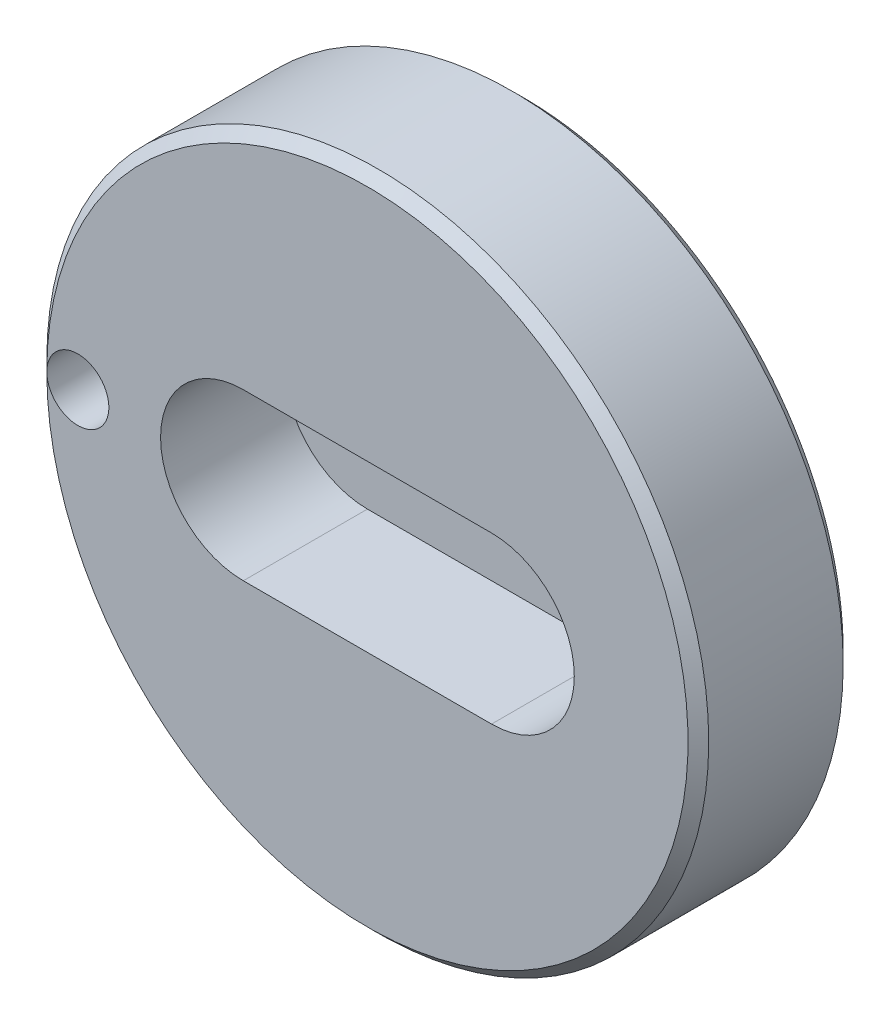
ISO-10303-21;
HEADER;
FILE_DESCRIPTION(('STEP AP214'),'2;1');
FILE_NAME('part.step','',(''),(''),'','','');
FILE_SCHEMA(('AUTOMOTIVE_DESIGN { 1 0 10303 214 1 1 1 1 }'));
ENDSEC;
DATA;
#1=APPLICATION_CONTEXT('core data for automotive mechanical design processes');
#2=APPLICATION_PROTOCOL_DEFINITION('international standard','automotive_design',2000,#1);
#3=PRODUCT_CONTEXT('',#1,'mechanical');
#4=PRODUCT('Part','Part','',(#3));
#5=PRODUCT_RELATED_PRODUCT_CATEGORY('part','',(#4));
#6=PRODUCT_DEFINITION_FORMATION('','',#4);
#7=PRODUCT_DEFINITION_CONTEXT('part definition',#1,'design');
#8=PRODUCT_DEFINITION('design','',#6,#7);
#9=PRODUCT_DEFINITION_SHAPE('','',#8);
#10=(LENGTH_UNIT() NAMED_UNIT(*) SI_UNIT(.MILLI.,.METRE.));
#11=(NAMED_UNIT(*) PLANE_ANGLE_UNIT() SI_UNIT($,.RADIAN.));
#12=(NAMED_UNIT(*) SI_UNIT($,.STERADIAN.) SOLID_ANGLE_UNIT());
#13=UNCERTAINTY_MEASURE_WITH_UNIT(LENGTH_MEASURE(1.E-05),#10,'distance_accuracy_value','');
#14=(GEOMETRIC_REPRESENTATION_CONTEXT(3) GLOBAL_UNCERTAINTY_ASSIGNED_CONTEXT((#13)) GLOBAL_UNIT_ASSIGNED_CONTEXT((#10,
#11,#12)) REPRESENTATION_CONTEXT('',''));
#15=CARTESIAN_POINT('',(0.,0.,0.));
#16=DIRECTION('',(0.,0.,1.));
#17=DIRECTION('',(1.,0.,0.));
#18=AXIS2_PLACEMENT_3D('',#15,#16,#17);
#19=CARTESIAN_POINT('',(0.,0.,7.5));
#20=DIRECTION('',(0.,0.,1.));
#21=DIRECTION('',(1.,0.,0.));
#22=AXIS2_PLACEMENT_3D('',#19,#20,#21);
#23=PLANE('',#22);
#24=CARTESIAN_POINT('',(-6.,0.,7.5));
#25=DIRECTION('',(0.,0.,1.));
#26=DIRECTION('',(1.,0.,0.));
#27=AXIS2_PLACEMENT_3D('',#24,#25,#26);
#28=CIRCLE('',#27,4.);
#29=CARTESIAN_POINT('',(-6.,4.,7.5));
#30=VERTEX_POINT('',#29);
#31=CARTESIAN_POINT('',(-6.,-4.,7.5));
#32=VERTEX_POINT('',#31);
#33=EDGE_CURVE('E47',#30,#32,#28,.T.);
#34=ORIENTED_EDGE('',*,*,#33,.F.);
#35=DIRECTION('',(-1.,0.,0.));
#36=VECTOR('',#35,1.);
#37=CARTESIAN_POINT('',(-6.,4.,7.5));
#38=LINE('',#37,#36);
#39=CARTESIAN_POINT('',(6.,4.,7.5));
#40=VERTEX_POINT('',#39);
#41=EDGE_CURVE('E96',#40,#30,#38,.T.);
#42=ORIENTED_EDGE('',*,*,#41,.F.);
#43=CARTESIAN_POINT('',(6.,0.,7.5));
#44=DIRECTION('',(0.,0.,1.));
#45=DIRECTION('',(1.,0.,0.));
#46=AXIS2_PLACEMENT_3D('',#43,#44,#45);
#47=CIRCLE('',#46,4.);
#48=CARTESIAN_POINT('',(6.,-4.,7.5));
#49=VERTEX_POINT('',#48);
#50=EDGE_CURVE('E99',#49,#40,#47,.T.);
#51=ORIENTED_EDGE('',*,*,#50,.F.);
#52=DIRECTION('',(1.,0.,0.));
#53=VECTOR('',#52,1.);
#54=CARTESIAN_POINT('',(-6.,-4.,7.5));
#55=LINE('',#54,#53);
#56=EDGE_CURVE('E105',#32,#49,#55,.T.);
#57=ORIENTED_EDGE('',*,*,#56,.F.);
#58=EDGE_LOOP('',(#34,#42,#51,#57));
#59=FACE_BOUND('',#58,.T.);
#60=CARTESIAN_POINT('',(-14.,0.,7.5));
#61=DIRECTION('',(0.,0.,1.));
#62=DIRECTION('',(1.,0.,0.));
#63=AXIS2_PLACEMENT_3D('',#60,#61,#62);
#64=CIRCLE('',#63,1.5);
#65=CARTESIAN_POINT('',(-15.5,0.,7.5));
#66=VERTEX_POINT('',#65);
#67=EDGE_CURVE('E119',#66,#66,#64,.T.);
#68=ORIENTED_EDGE('',*,*,#67,.F.);
#69=CARTESIAN_POINT('',(0.,0.,7.5));
#70=DIRECTION('',(0.,0.,1.));
#71=DIRECTION('',(1.,0.,0.));
#72=AXIS2_PLACEMENT_3D('',#69,#70,#71);
#73=CIRCLE('',#72,15.5);
#74=EDGE_CURVE('E11',#66,#66,#73,.T.);
#75=ORIENTED_EDGE('',*,*,#74,.T.);
#76=EDGE_LOOP('',(#68,#75));
#77=FACE_BOUND('',#76,.T.);
#78=ADVANCED_FACE('F32',(#59,#77),#23,.T.);
#79=CARTESIAN_POINT('',(0.,0.,0.));
#80=DIRECTION('',(0.,0.,1.));
#81=DIRECTION('',(1.,0.,0.));
#82=AXIS2_PLACEMENT_3D('',#79,#80,#81);
#83=PLANE('',#82);
#84=CARTESIAN_POINT('',(0.,0.,0.));
#85=DIRECTION('',(0.,0.,-1.));
#86=DIRECTION('',(-1.,0.,0.));
#87=AXIS2_PLACEMENT_3D('',#84,#85,#86);
#88=CIRCLE('',#87,5.6);
#89=CARTESIAN_POINT('',(-5.6,0.,0.));
#90=VERTEX_POINT('',#89);
#91=EDGE_CURVE('E115',#90,#90,#88,.T.);
#92=ORIENTED_EDGE('',*,*,#91,.F.);
#93=EDGE_LOOP('',(#92));
#94=FACE_BOUND('',#93,.T.);
#95=CARTESIAN_POINT('',(-14.,0.,0.));
#96=DIRECTION('',(0.,0.,1.));
#97=DIRECTION('',(1.,0.,0.));
#98=AXIS2_PLACEMENT_3D('',#95,#96,#97);
#99=CIRCLE('',#98,1.5);
#100=CARTESIAN_POINT('',(-15.5,0.,0.));
#101=VERTEX_POINT('',#100);
#102=EDGE_CURVE('E111',#101,#101,#99,.T.);
#103=ORIENTED_EDGE('',*,*,#102,.T.);
#104=CARTESIAN_POINT('',(0.,0.,0.));
#105=DIRECTION('',(0.,0.,1.));
#106=DIRECTION('',(1.,0.,0.));
#107=AXIS2_PLACEMENT_3D('',#104,#105,#106);
#108=CIRCLE('',#107,15.5);
#109=EDGE_CURVE('E40',#101,#101,#108,.F.);
#110=ORIENTED_EDGE('',*,*,#109,.T.);
#111=EDGE_LOOP('',(#103,#110));
#112=FACE_BOUND('',#111,.T.);
#113=ADVANCED_FACE('F136',(#94,#112),#83,.F.);
#114=CARTESIAN_POINT('',(0.,0.,7.5));
#115=DIRECTION('',(0.,0.,-1.));
#116=DIRECTION('',(-1.,0.,0.));
#117=AXIS2_PLACEMENT_3D('',#114,#115,#116);
#118=CYLINDRICAL_SURFACE('',#117,16.);
#119=CARTESIAN_POINT('',(0.,0.,0.499999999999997));
#120=DIRECTION('',(0.,0.,1.));
#121=DIRECTION('',(1.,0.,0.));
#122=AXIS2_PLACEMENT_3D('',#119,#120,#121);
#123=CIRCLE('',#122,16.);
#124=CARTESIAN_POINT('',(16.,0.,0.499999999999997));
#125=VERTEX_POINT('',#124);
#126=EDGE_CURVE('E132',#125,#125,#123,.T.);
#127=ORIENTED_EDGE('',*,*,#126,.T.);
#128=EDGE_LOOP('',(#127));
#129=FACE_BOUND('',#128,.T.);
#130=CARTESIAN_POINT('',(0.,0.,7.));
#131=DIRECTION('',(0.,0.,1.));
#132=DIRECTION('',(1.,0.,0.));
#133=AXIS2_PLACEMENT_3D('',#130,#131,#132);
#134=CIRCLE('',#133,16.);
#135=CARTESIAN_POINT('',(16.,0.,7.));
#136=VERTEX_POINT('',#135);
#137=EDGE_CURVE('E129',#136,#136,#134,.F.);
#138=ORIENTED_EDGE('',*,*,#137,.T.);
#139=EDGE_LOOP('',(#138));
#140=FACE_BOUND('',#139,.T.);
#141=ADVANCED_FACE('F145',(#129,#140),#118,.T.);
#142=CARTESIAN_POINT('',(-14.,0.,7.5));
#143=DIRECTION('',(0.,0.,-1.));
#144=DIRECTION('',(-1.,0.,0.));
#145=AXIS2_PLACEMENT_3D('',#142,#143,#144);
#146=CYLINDRICAL_SURFACE('',#145,1.5);
#147=ORIENTED_EDGE('',*,*,#67,.T.);
#148=EDGE_LOOP('',(#147));
#149=FACE_BOUND('',#148,.T.);
#150=ORIENTED_EDGE('',*,*,#102,.F.);
#151=EDGE_LOOP('',(#150));
#152=FACE_BOUND('',#151,.T.);
#153=ADVANCED_FACE('F148',(#149,#152),#146,.F.);
#154=CARTESIAN_POINT('',(0.,0.,-3.));
#155=DIRECTION('',(0.,0.,1.));
#156=DIRECTION('',(1.,0.,0.));
#157=AXIS2_PLACEMENT_3D('',#154,#155,#156);
#158=CYLINDRICAL_SURFACE('',#157,5.6);
#159=CARTESIAN_POINT('',(0.,0.,-2.5));
#160=DIRECTION('',(0.,0.,-1.));
#161=DIRECTION('',(-1.,0.,0.));
#162=AXIS2_PLACEMENT_3D('',#159,#160,#161);
#163=CIRCLE('',#162,5.6);
#164=CARTESIAN_POINT('',(-5.6,0.,-2.5));
#165=VERTEX_POINT('',#164);
#166=EDGE_CURVE('E126',#165,#165,#163,.F.);
#167=ORIENTED_EDGE('',*,*,#166,.T.);
#168=EDGE_LOOP('',(#167));
#169=FACE_BOUND('',#168,.T.);
#170=ORIENTED_EDGE('',*,*,#91,.T.);
#171=EDGE_LOOP('',(#170));
#172=FACE_BOUND('',#171,.T.);
#173=ADVANCED_FACE('F176',(#169,#172),#158,.T.);
#174=CARTESIAN_POINT('',(0.,0.,-3.));
#175=DIRECTION('',(0.,0.,-1.));
#176=DIRECTION('',(-1.,0.,0.));
#177=AXIS2_PLACEMENT_3D('',#174,#175,#176);
#178=PLANE('',#177);
#179=CARTESIAN_POINT('',(0.,0.,-3.));
#180=DIRECTION('',(0.,0.,-1.));
#181=DIRECTION('',(-1.,0.,0.));
#182=AXIS2_PLACEMENT_3D('',#179,#180,#181);
#183=CIRCLE('',#182,5.10000000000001);
#184=CARTESIAN_POINT('',(-5.10000000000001,0.,-3.));
#185=VERTEX_POINT('',#184);
#186=EDGE_CURVE('E118',#185,#185,#183,.T.);
#187=ORIENTED_EDGE('',*,*,#186,.T.);
#188=EDGE_LOOP('',(#187));
#189=FACE_BOUND('',#188,.T.);
#190=ADVANCED_FACE('F171',(#189),#178,.T.);
#191=CARTESIAN_POINT('',(0.,0.,-3.));
#192=DIRECTION('',(0.,0.,1.));
#193=DIRECTION('',(1.,0.,0.));
#194=AXIS2_PLACEMENT_3D('',#191,#192,#193);
#195=CONICAL_SURFACE('',#194,5.10000000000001,0.785398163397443);
#196=ORIENTED_EDGE('',*,*,#166,.F.);
#197=EDGE_LOOP('',(#196));
#198=FACE_BOUND('',#197,.T.);
#199=ORIENTED_EDGE('',*,*,#186,.F.);
#200=EDGE_LOOP('',(#199));
#201=FACE_BOUND('',#200,.T.);
#202=ADVANCED_FACE('F142',(#198,#201),#195,.T.);
#203=CARTESIAN_POINT('',(0.,0.,0.499999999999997));
#204=DIRECTION('',(0.,0.,1.));
#205=DIRECTION('',(1.,0.,0.));
#206=AXIS2_PLACEMENT_3D('',#203,#204,#205);
#207=CONICAL_SURFACE('',#206,16.,0.785398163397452);
#208=ORIENTED_EDGE('',*,*,#109,.F.);
#209=EDGE_LOOP('',(#208));
#210=FACE_BOUND('',#209,.T.);
#211=ORIENTED_EDGE('',*,*,#126,.F.);
#212=EDGE_LOOP('',(#211));
#213=FACE_BOUND('',#212,.T.);
#214=ADVANCED_FACE('F139',(#210,#213),#207,.T.);
#215=CARTESIAN_POINT('',(0.,0.,7.5));
#216=DIRECTION('',(0.,0.,-1.));
#217=DIRECTION('',(-1.,0.,0.));
#218=AXIS2_PLACEMENT_3D('',#215,#216,#217);
#219=CONICAL_SURFACE('',#218,15.5,0.785398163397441);
#220=ORIENTED_EDGE('',*,*,#137,.F.);
#221=EDGE_LOOP('',(#220));
#222=FACE_BOUND('',#221,.T.);
#223=ORIENTED_EDGE('',*,*,#74,.F.);
#224=EDGE_LOOP('',(#223));
#225=FACE_BOUND('',#224,.T.);
#226=ADVANCED_FACE('F34',(#222,#225),#219,.T.);
#227=CARTESIAN_POINT('',(-6.,0.,1.5));
#228=DIRECTION('',(0.,0.,1.));
#229=DIRECTION('',(1.,0.,0.));
#230=AXIS2_PLACEMENT_3D('',#227,#228,#229);
#231=CYLINDRICAL_SURFACE('',#230,4.);
#232=ORIENTED_EDGE('',*,*,#33,.T.);
#233=DIRECTION('',(0.,0.,1.));
#234=VECTOR('',#233,1.);
#235=CARTESIAN_POINT('',(-6.,-4.,1.5));
#236=LINE('',#235,#234);
#237=CARTESIAN_POINT('',(-6.,-4.,1.5));
#238=VERTEX_POINT('',#237);
#239=EDGE_CURVE('E74',#238,#32,#236,.T.);
#240=ORIENTED_EDGE('',*,*,#239,.F.);
#241=CARTESIAN_POINT('',(-6.,0.,1.5));
#242=DIRECTION('',(0.,0.,1.));
#243=DIRECTION('',(1.,0.,0.));
#244=AXIS2_PLACEMENT_3D('',#241,#242,#243);
#245=CIRCLE('',#244,4.);
#246=CARTESIAN_POINT('',(-6.,4.,1.5));
#247=VERTEX_POINT('',#246);
#248=EDGE_CURVE('E78',#247,#238,#245,.T.);
#249=ORIENTED_EDGE('',*,*,#248,.F.);
#250=DIRECTION('',(0.,0.,1.));
#251=VECTOR('',#250,1.);
#252=CARTESIAN_POINT('',(-6.,4.,1.5));
#253=LINE('',#252,#251);
#254=EDGE_CURVE('E109',#247,#30,#253,.T.);
#255=ORIENTED_EDGE('',*,*,#254,.T.);
#256=EDGE_LOOP('',(#232,#240,#249,#255));
#257=FACE_BOUND('',#256,.T.);
#258=ADVANCED_FACE('F76',(#257),#231,.F.);
#259=CARTESIAN_POINT('',(-6.,4.,1.5));
#260=DIRECTION('',(0.,1.,0.));
#261=DIRECTION('',(-1.,0.,0.));
#262=AXIS2_PLACEMENT_3D('',#259,#260,#261);
#263=PLANE('',#262);
#264=ORIENTED_EDGE('',*,*,#41,.T.);
#265=ORIENTED_EDGE('',*,*,#254,.F.);
#266=DIRECTION('',(-1.,0.,0.));
#267=VECTOR('',#266,1.);
#268=CARTESIAN_POINT('',(-6.,4.,1.5));
#269=LINE('',#268,#267);
#270=CARTESIAN_POINT('',(6.,4.,1.5));
#271=VERTEX_POINT('',#270);
#272=EDGE_CURVE('E84',#271,#247,#269,.T.);
#273=ORIENTED_EDGE('',*,*,#272,.F.);
#274=DIRECTION('',(0.,0.,1.));
#275=VECTOR('',#274,1.);
#276=CARTESIAN_POINT('',(6.,4.,1.5));
#277=LINE('',#276,#275);
#278=EDGE_CURVE('E112',#271,#40,#277,.T.);
#279=ORIENTED_EDGE('',*,*,#278,.T.);
#280=EDGE_LOOP('',(#264,#265,#273,#279));
#281=FACE_BOUND('',#280,.T.);
#282=ADVANCED_FACE('F156',(#281),#263,.F.);
#283=CARTESIAN_POINT('',(6.,0.,1.5));
#284=DIRECTION('',(0.,0.,1.));
#285=DIRECTION('',(1.,0.,0.));
#286=AXIS2_PLACEMENT_3D('',#283,#284,#285);
#287=CYLINDRICAL_SURFACE('',#286,4.);
#288=ORIENTED_EDGE('',*,*,#50,.T.);
#289=ORIENTED_EDGE('',*,*,#278,.F.);
#290=CARTESIAN_POINT('',(6.,0.,1.5));
#291=DIRECTION('',(0.,0.,1.));
#292=DIRECTION('',(1.,0.,0.));
#293=AXIS2_PLACEMENT_3D('',#290,#291,#292);
#294=CIRCLE('',#293,4.);
#295=CARTESIAN_POINT('',(6.,-4.,1.5));
#296=VERTEX_POINT('',#295);
#297=EDGE_CURVE('E92',#296,#271,#294,.T.);
#298=ORIENTED_EDGE('',*,*,#297,.F.);
#299=DIRECTION('',(0.,0.,1.));
#300=VECTOR('',#299,1.);
#301=CARTESIAN_POINT('',(6.,-4.,1.5));
#302=LINE('',#301,#300);
#303=EDGE_CURVE('E83',#296,#49,#302,.T.);
#304=ORIENTED_EDGE('',*,*,#303,.T.);
#305=EDGE_LOOP('',(#288,#289,#298,#304));
#306=FACE_BOUND('',#305,.T.);
#307=ADVANCED_FACE('F193',(#306),#287,.F.);
#308=CARTESIAN_POINT('',(-6.,-4.,1.5));
#309=DIRECTION('',(0.,-1.,0.));
#310=DIRECTION('',(0.,0.,-1.));
#311=AXIS2_PLACEMENT_3D('',#308,#309,#310);
#312=PLANE('',#311);
#313=ORIENTED_EDGE('',*,*,#56,.T.);
#314=ORIENTED_EDGE('',*,*,#303,.F.);
#315=DIRECTION('',(1.,0.,0.));
#316=VECTOR('',#315,1.);
#317=CARTESIAN_POINT('',(-6.,-4.,1.5));
#318=LINE('',#317,#316);
#319=EDGE_CURVE('E87',#238,#296,#318,.T.);
#320=ORIENTED_EDGE('',*,*,#319,.F.);
#321=ORIENTED_EDGE('',*,*,#239,.T.);
#322=EDGE_LOOP('',(#313,#314,#320,#321));
#323=FACE_BOUND('',#322,.T.);
#324=ADVANCED_FACE('F88',(#323),#312,.F.);
#325=CARTESIAN_POINT('',(-6.,0.,1.5));
#326=DIRECTION('',(0.,0.,1.));
#327=DIRECTION('',(1.,0.,0.));
#328=AXIS2_PLACEMENT_3D('',#325,#326,#327);
#329=PLANE('',#328);
#330=ORIENTED_EDGE('',*,*,#248,.T.);
#331=ORIENTED_EDGE('',*,*,#319,.T.);
#332=ORIENTED_EDGE('',*,*,#297,.T.);
#333=ORIENTED_EDGE('',*,*,#272,.T.);
#334=EDGE_LOOP('',(#330,#331,#332,#333));
#335=FACE_BOUND('',#334,.T.);
#336=ADVANCED_FACE('F94',(#335),#329,.T.);
#337=CLOSED_SHELL('',(#78,#113,#141,#153,#173,#190,#202,#214,#226,#258,#282,#307,#324,#336));
#338=MANIFOLD_SOLID_BREP('B2',#337);
#339=ADVANCED_BREP_SHAPE_REPRESENTATION('',(#18,#338),#14);
#340=SHAPE_DEFINITION_REPRESENTATION(#9,#339);
ENDSEC;
END-ISO-10303-21;
